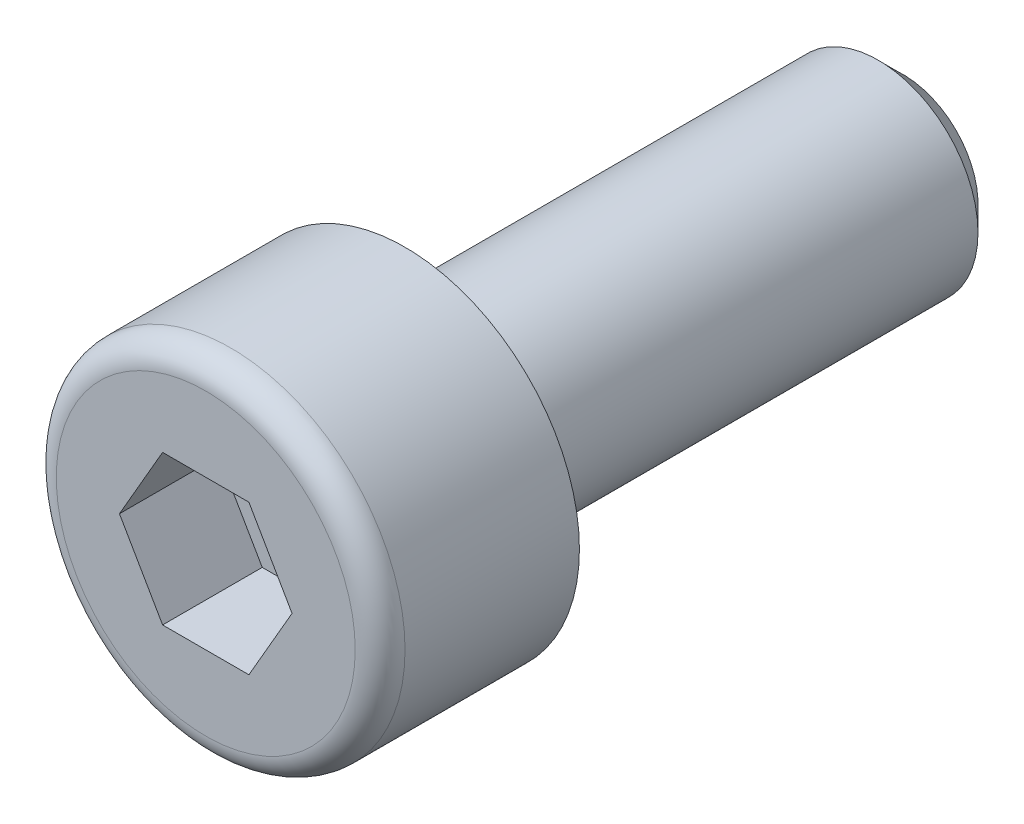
from build123d import *

# Parameters (mm, degrees)
ESQUISSE1_R             = 3.5
BASE_EXTRUSION_DEPTH    = 4
ESQUISSE2_R             = 2
BOSS_EXTRU_1_DEPTH      = 10
CHANFREIN1_SIZE         = 0.5
ENL_V_MAT_EXTRU_1_DEPTH = 2
CONG_1_R                = 0.5


with BuildPart() as part:
    # Esquisse1 → Base-Extrusion (new body)
    with BuildSketch(Plane.XY):
        Circle(ESQUISSE1_R)
    extrude(amount=BASE_EXTRUSION_DEPTH)

    # Esquisse2 → Boss.-Extru.1 (add)
    with BuildSketch(Plane(origin=(0, 0, 0), x_dir=(-1, 0, 0), z_dir=(0, 0, -1))):
        with Locations(Location((0, 0, 0), (0, 0, 180))):
            Circle(ESQUISSE2_R)
    extrude(amount=BOSS_EXTRU_1_DEPTH)

    # Chanfrein1
    chanfrein1_edges = [part.edges().sort_by_distance(p)[0] for p in [
        (-2, 0, -10),
    ]]
    chamfer(chanfrein1_edges, length=CHANFREIN1_SIZE)

    # Esquisse3 → Enl_v. mat.-Extru.1 (cut)
    with BuildSketch(Plane.XY.offset(4)):
        Polygon((1.732050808, 0), (0.866025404, 1.5), (-0.866025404, 1.5), (-1.732050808, 0), (-0.866025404, -1.5), (0.866025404, -1.5), align=None)
    extrude(amount=-ENL_V_MAT_EXTRU_1_DEPTH, mode=Mode.SUBTRACT)

    # Cong_1
    cong_1_edges = [part.edges().sort_by_distance(p)[0] for p in [
        (-3.5, 0, 4),
    ]]
    fillet(cong_1_edges, radius=CONG_1_R)


solid = part.part
